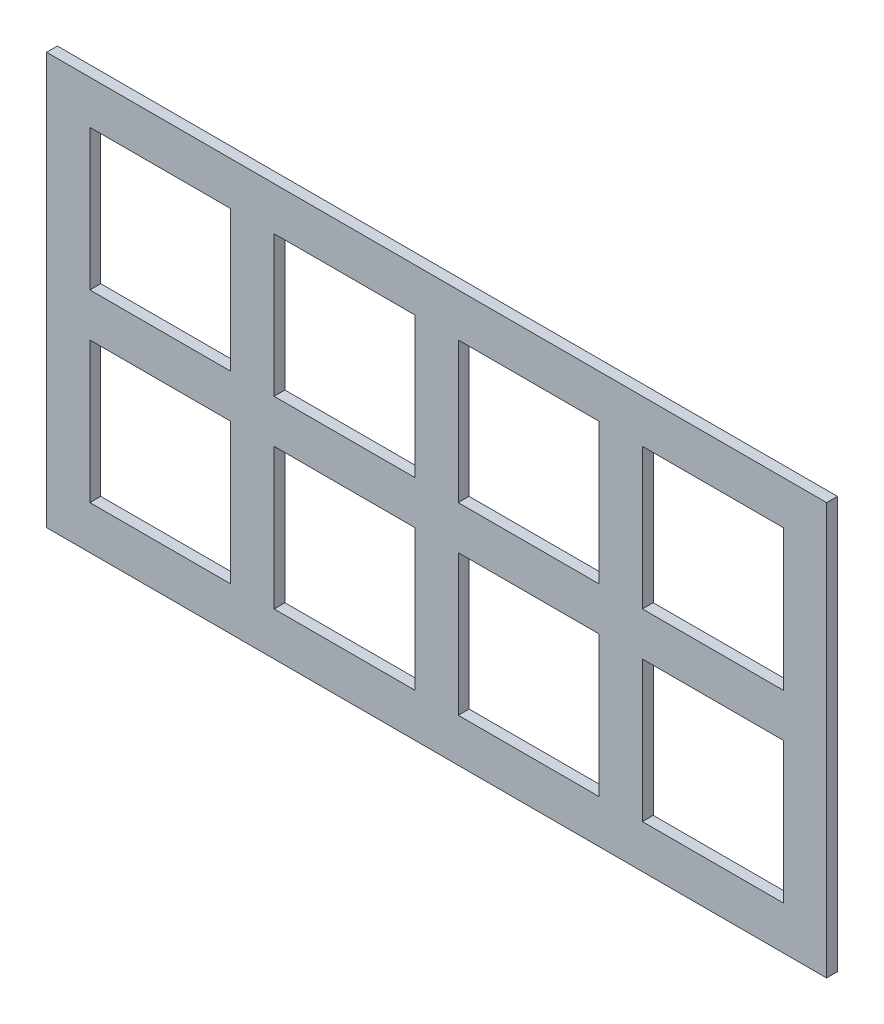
ISO-10303-21;
HEADER;
FILE_DESCRIPTION(('STEP AP214'),'2;1');
FILE_NAME('part.step','',(''),(''),'','','');
FILE_SCHEMA(('AUTOMOTIVE_DESIGN { 1 0 10303 214 1 1 1 1 }'));
ENDSEC;
DATA;
#1=APPLICATION_CONTEXT('core data for automotive mechanical design processes');
#2=APPLICATION_PROTOCOL_DEFINITION('international standard','automotive_design',2000,#1);
#3=PRODUCT_CONTEXT('',#1,'mechanical');
#4=PRODUCT('Part','Part','',(#3));
#5=PRODUCT_RELATED_PRODUCT_CATEGORY('part','',(#4));
#6=PRODUCT_DEFINITION_FORMATION('','',#4);
#7=PRODUCT_DEFINITION_CONTEXT('part definition',#1,'design');
#8=PRODUCT_DEFINITION('design','',#6,#7);
#9=PRODUCT_DEFINITION_SHAPE('','',#8);
#10=(LENGTH_UNIT() NAMED_UNIT(*) SI_UNIT(.MILLI.,.METRE.));
#11=(NAMED_UNIT(*) PLANE_ANGLE_UNIT() SI_UNIT($,.RADIAN.));
#12=(NAMED_UNIT(*) SI_UNIT($,.STERADIAN.) SOLID_ANGLE_UNIT());
#13=UNCERTAINTY_MEASURE_WITH_UNIT(LENGTH_MEASURE(1.E-05),#10,'distance_accuracy_value','');
#14=(GEOMETRIC_REPRESENTATION_CONTEXT(3) GLOBAL_UNCERTAINTY_ASSIGNED_CONTEXT((#13)) GLOBAL_UNIT_ASSIGNED_CONTEXT((#10,
#11,#12)) REPRESENTATION_CONTEXT('',''));
#15=CARTESIAN_POINT('',(0.,0.,0.));
#16=DIRECTION('',(0.,0.,1.));
#17=DIRECTION('',(1.,0.,0.));
#18=AXIS2_PLACEMENT_3D('',#15,#16,#17);
#19=CARTESIAN_POINT('',(0.,0.,12.7));
#20=DIRECTION('',(0.,0.,-1.));
#21=DIRECTION('',(-1.,0.,0.));
#22=AXIS2_PLACEMENT_3D('',#19,#20,#21);
#23=PLANE('',#22);
#24=DIRECTION('',(0.,-1.,0.));
#25=VECTOR('',#24,1.);
#26=CARTESIAN_POINT('',(-406.4,25.4,12.7));
#27=LINE('',#26,#25);
#28=CARTESIAN_POINT('',(-406.4,190.5,12.7));
#29=VERTEX_POINT('',#28);
#30=CARTESIAN_POINT('',(-406.4,25.4,12.7));
#31=VERTEX_POINT('',#30);
#32=EDGE_CURVE('E334',#29,#31,#27,.T.);
#33=ORIENTED_EDGE('',*,*,#32,.F.);
#34=DIRECTION('',(-1.,0.,0.));
#35=VECTOR('',#34,1.);
#36=CARTESIAN_POINT('',(-406.4,190.5,12.7));
#37=LINE('',#36,#35);
#38=CARTESIAN_POINT('',(-241.3,190.5,12.7));
#39=VERTEX_POINT('',#38);
#40=EDGE_CURVE('E345',#39,#29,#37,.T.);
#41=ORIENTED_EDGE('',*,*,#40,.F.);
#42=DIRECTION('',(0.,1.,0.));
#43=VECTOR('',#42,1.);
#44=CARTESIAN_POINT('',(-241.3,25.4,12.7));
#45=LINE('',#44,#43);
#46=CARTESIAN_POINT('',(-241.3,25.4,12.7));
#47=VERTEX_POINT('',#46);
#48=EDGE_CURVE('E341',#47,#39,#45,.T.);
#49=ORIENTED_EDGE('',*,*,#48,.F.);
#50=DIRECTION('',(1.,0.,0.));
#51=VECTOR('',#50,1.);
#52=CARTESIAN_POINT('',(-406.4,25.4,12.7));
#53=LINE('',#52,#51);
#54=EDGE_CURVE('E337',#31,#47,#53,.T.);
#55=ORIENTED_EDGE('',*,*,#54,.F.);
#56=EDGE_LOOP('',(#33,#41,#49,#55));
#57=FACE_BOUND('',#56,.T.);
#58=DIRECTION('',(0.,1.,0.));
#59=VECTOR('',#58,1.);
#60=CARTESIAN_POINT('',(406.4,25.4,12.7));
#61=LINE('',#60,#59);
#62=CARTESIAN_POINT('',(406.4,25.4,12.7));
#63=VERTEX_POINT('',#62);
#64=CARTESIAN_POINT('',(406.4,190.5,12.7));
#65=VERTEX_POINT('',#64);
#66=EDGE_CURVE('E420',#63,#65,#61,.T.);
#67=ORIENTED_EDGE('',*,*,#66,.F.);
#68=DIRECTION('',(1.,0.,0.));
#69=VECTOR('',#68,1.);
#70=CARTESIAN_POINT('',(241.3,25.4,12.7));
#71=LINE('',#70,#69);
#72=CARTESIAN_POINT('',(241.3,25.4,12.7));
#73=VERTEX_POINT('',#72);
#74=EDGE_CURVE('E431',#73,#63,#71,.T.);
#75=ORIENTED_EDGE('',*,*,#74,.F.);
#76=DIRECTION('',(0.,-1.,0.));
#77=VECTOR('',#76,1.);
#78=CARTESIAN_POINT('',(241.3,25.4,12.7));
#79=LINE('',#78,#77);
#80=CARTESIAN_POINT('',(241.3,190.5,12.7));
#81=VERTEX_POINT('',#80);
#82=EDGE_CURVE('E427',#81,#73,#79,.T.);
#83=ORIENTED_EDGE('',*,*,#82,.F.);
#84=DIRECTION('',(-1.,0.,0.));
#85=VECTOR('',#84,1.);
#86=CARTESIAN_POINT('',(241.3,190.5,12.7));
#87=LINE('',#86,#85);
#88=EDGE_CURVE('E423',#65,#81,#87,.T.);
#89=ORIENTED_EDGE('',*,*,#88,.F.);
#90=EDGE_LOOP('',(#67,#75,#83,#89));
#91=FACE_BOUND('',#90,.T.);
#92=DIRECTION('',(1.,0.,0.));
#93=VECTOR('',#92,1.);
#94=CARTESIAN_POINT('',(-190.5,25.4,12.7));
#95=LINE('',#94,#93);
#96=CARTESIAN_POINT('',(-190.5,25.4,12.7));
#97=VERTEX_POINT('',#96);
#98=CARTESIAN_POINT('',(-25.4,25.4,12.7));
#99=VERTEX_POINT('',#98);
#100=EDGE_CURVE('E506',#97,#99,#95,.T.);
#101=ORIENTED_EDGE('',*,*,#100,.F.);
#102=DIRECTION('',(0.,-1.,0.));
#103=VECTOR('',#102,1.);
#104=CARTESIAN_POINT('',(-190.5,25.4,12.7));
#105=LINE('',#104,#103);
#106=CARTESIAN_POINT('',(-190.5,190.5,12.7));
#107=VERTEX_POINT('',#106);
#108=EDGE_CURVE('E517',#107,#97,#105,.T.);
#109=ORIENTED_EDGE('',*,*,#108,.F.);
#110=DIRECTION('',(-1.,0.,0.));
#111=VECTOR('',#110,1.);
#112=CARTESIAN_POINT('',(-190.5,190.5,12.7));
#113=LINE('',#112,#111);
#114=CARTESIAN_POINT('',(-25.4,190.5,12.7));
#115=VERTEX_POINT('',#114);
#116=EDGE_CURVE('E513',#115,#107,#113,.T.);
#117=ORIENTED_EDGE('',*,*,#116,.F.);
#118=DIRECTION('',(0.,1.,0.));
#119=VECTOR('',#118,1.);
#120=CARTESIAN_POINT('',(-25.4,25.4,12.7));
#121=LINE('',#120,#119);
#122=EDGE_CURVE('E509',#99,#115,#121,.T.);
#123=ORIENTED_EDGE('',*,*,#122,.F.);
#124=EDGE_LOOP('',(#101,#109,#117,#123));
#125=FACE_BOUND('',#124,.T.);
#126=DIRECTION('',(1.,0.,0.));
#127=VECTOR('',#126,1.);
#128=CARTESIAN_POINT('',(25.4,25.4,12.7));
#129=LINE('',#128,#127);
#130=CARTESIAN_POINT('',(25.4,25.4,12.7));
#131=VERTEX_POINT('',#130);
#132=CARTESIAN_POINT('',(190.5,25.4,12.7));
#133=VERTEX_POINT('',#132);
#134=EDGE_CURVE('E592',#131,#133,#129,.T.);
#135=ORIENTED_EDGE('',*,*,#134,.F.);
#136=DIRECTION('',(0.,-1.,0.));
#137=VECTOR('',#136,1.);
#138=CARTESIAN_POINT('',(25.4,25.4,12.7));
#139=LINE('',#138,#137);
#140=CARTESIAN_POINT('',(25.4,190.5,12.7));
#141=VERTEX_POINT('',#140);
#142=EDGE_CURVE('E603',#141,#131,#139,.T.);
#143=ORIENTED_EDGE('',*,*,#142,.F.);
#144=DIRECTION('',(-1.,0.,0.));
#145=VECTOR('',#144,1.);
#146=CARTESIAN_POINT('',(25.4,190.5,12.7));
#147=LINE('',#146,#145);
#148=CARTESIAN_POINT('',(190.5,190.5,12.7));
#149=VERTEX_POINT('',#148);
#150=EDGE_CURVE('E599',#149,#141,#147,.T.);
#151=ORIENTED_EDGE('',*,*,#150,.F.);
#152=DIRECTION('',(0.,1.,0.));
#153=VECTOR('',#152,1.);
#154=CARTESIAN_POINT('',(190.5,25.4,12.7));
#155=LINE('',#154,#153);
#156=EDGE_CURVE('E595',#133,#149,#155,.T.);
#157=ORIENTED_EDGE('',*,*,#156,.F.);
#158=EDGE_LOOP('',(#135,#143,#151,#157));
#159=FACE_BOUND('',#158,.T.);
#160=DIRECTION('',(0.,1.,0.));
#161=VECTOR('',#160,1.);
#162=CARTESIAN_POINT('',(457.2,-241.3,12.7));
#163=LINE('',#162,#161);
#164=CARTESIAN_POINT('',(457.2,-241.3,12.7));
#165=VERTEX_POINT('',#164);
#166=CARTESIAN_POINT('',(457.2,241.3,12.7));
#167=VERTEX_POINT('',#166);
#168=EDGE_CURVE('E635',#165,#167,#163,.T.);
#169=ORIENTED_EDGE('',*,*,#168,.T.);
#170=DIRECTION('',(-1.,0.,0.));
#171=VECTOR('',#170,1.);
#172=CARTESIAN_POINT('',(-457.2,241.3,12.7));
#173=LINE('',#172,#171);
#174=CARTESIAN_POINT('',(-457.2,241.3,12.7));
#175=VERTEX_POINT('',#174);
#176=EDGE_CURVE('E639',#167,#175,#173,.T.);
#177=ORIENTED_EDGE('',*,*,#176,.T.);
#178=DIRECTION('',(0.,-1.,0.));
#179=VECTOR('',#178,1.);
#180=CARTESIAN_POINT('',(-457.2,-241.3,12.7));
#181=LINE('',#180,#179);
#182=CARTESIAN_POINT('',(-457.2,-241.3,12.7));
#183=VERTEX_POINT('',#182);
#184=EDGE_CURVE('E643',#175,#183,#181,.T.);
#185=ORIENTED_EDGE('',*,*,#184,.T.);
#186=DIRECTION('',(1.,0.,0.));
#187=VECTOR('',#186,1.);
#188=CARTESIAN_POINT('',(-457.2,-241.3,12.7));
#189=LINE('',#188,#187);
#190=EDGE_CURVE('E646',#183,#165,#189,.T.);
#191=ORIENTED_EDGE('',*,*,#190,.T.);
#192=EDGE_LOOP('',(#169,#177,#185,#191));
#193=FACE_BOUND('',#192,.T.);
#194=DIRECTION('',(-1.,0.,0.));
#195=VECTOR('',#194,1.);
#196=CARTESIAN_POINT('',(-190.5,-25.4,12.7));
#197=LINE('',#196,#195);
#198=CARTESIAN_POINT('',(-25.4,-25.4,12.7));
#199=VERTEX_POINT('',#198);
#200=CARTESIAN_POINT('',(-190.5,-25.4,12.7));
#201=VERTEX_POINT('',#200);
#202=EDGE_CURVE('E549',#199,#201,#197,.T.);
#203=ORIENTED_EDGE('',*,*,#202,.F.);
#204=DIRECTION('',(0.,1.,0.));
#205=VECTOR('',#204,1.);
#206=CARTESIAN_POINT('',(-25.4,-190.5,12.7));
#207=LINE('',#206,#205);
#208=CARTESIAN_POINT('',(-25.4,-190.5,12.7));
#209=VERTEX_POINT('',#208);
#210=EDGE_CURVE('E560',#209,#199,#207,.T.);
#211=ORIENTED_EDGE('',*,*,#210,.F.);
#212=DIRECTION('',(1.,0.,0.));
#213=VECTOR('',#212,1.);
#214=CARTESIAN_POINT('',(-190.5,-190.5,12.7));
#215=LINE('',#214,#213);
#216=CARTESIAN_POINT('',(-190.5,-190.5,12.7));
#217=VERTEX_POINT('',#216);
#218=EDGE_CURVE('E556',#217,#209,#215,.T.);
#219=ORIENTED_EDGE('',*,*,#218,.F.);
#220=DIRECTION('',(0.,-1.,0.));
#221=VECTOR('',#220,1.);
#222=CARTESIAN_POINT('',(-190.5,-190.5,12.7));
#223=LINE('',#222,#221);
#224=EDGE_CURVE('E552',#201,#217,#223,.T.);
#225=ORIENTED_EDGE('',*,*,#224,.F.);
#226=EDGE_LOOP('',(#203,#211,#219,#225));
#227=FACE_BOUND('',#226,.T.);
#228=DIRECTION('',(-1.,0.,0.));
#229=VECTOR('',#228,1.);
#230=CARTESIAN_POINT('',(25.4,-25.4,12.7));
#231=LINE('',#230,#229);
#232=CARTESIAN_POINT('',(190.5,-25.4,12.7));
#233=VERTEX_POINT('',#232);
#234=CARTESIAN_POINT('',(25.4,-25.4,12.7));
#235=VERTEX_POINT('',#234);
#236=EDGE_CURVE('E463',#233,#235,#231,.T.);
#237=ORIENTED_EDGE('',*,*,#236,.F.);
#238=DIRECTION('',(0.,1.,0.));
#239=VECTOR('',#238,1.);
#240=CARTESIAN_POINT('',(190.5,-190.5,12.7));
#241=LINE('',#240,#239);
#242=CARTESIAN_POINT('',(190.5,-190.5,12.7));
#243=VERTEX_POINT('',#242);
#244=EDGE_CURVE('E474',#243,#233,#241,.T.);
#245=ORIENTED_EDGE('',*,*,#244,.F.);
#246=DIRECTION('',(1.,0.,0.));
#247=VECTOR('',#246,1.);
#248=CARTESIAN_POINT('',(25.4,-190.5,12.7));
#249=LINE('',#248,#247);
#250=CARTESIAN_POINT('',(25.4,-190.5,12.7));
#251=VERTEX_POINT('',#250);
#252=EDGE_CURVE('E470',#251,#243,#249,.T.);
#253=ORIENTED_EDGE('',*,*,#252,.F.);
#254=DIRECTION('',(0.,-1.,0.));
#255=VECTOR('',#254,1.);
#256=CARTESIAN_POINT('',(25.4,-190.5,12.7));
#257=LINE('',#256,#255);
#258=EDGE_CURVE('E466',#235,#251,#257,.T.);
#259=ORIENTED_EDGE('',*,*,#258,.F.);
#260=EDGE_LOOP('',(#237,#245,#253,#259));
#261=FACE_BOUND('',#260,.T.);
#262=DIRECTION('',(0.,-1.,0.));
#263=VECTOR('',#262,1.);
#264=CARTESIAN_POINT('',(-406.4,-190.5,12.7));
#265=LINE('',#264,#263);
#266=CARTESIAN_POINT('',(-406.4,-25.4,12.7));
#267=VERTEX_POINT('',#266);
#268=CARTESIAN_POINT('',(-406.4,-190.5,12.7));
#269=VERTEX_POINT('',#268);
#270=EDGE_CURVE('E377',#267,#269,#265,.T.);
#271=ORIENTED_EDGE('',*,*,#270,.F.);
#272=DIRECTION('',(-1.,0.,0.));
#273=VECTOR('',#272,1.);
#274=CARTESIAN_POINT('',(-406.4,-25.4,12.7));
#275=LINE('',#274,#273);
#276=CARTESIAN_POINT('',(-241.3,-25.4,12.7));
#277=VERTEX_POINT('',#276);
#278=EDGE_CURVE('E388',#277,#267,#275,.T.);
#279=ORIENTED_EDGE('',*,*,#278,.F.);
#280=DIRECTION('',(0.,1.,0.));
#281=VECTOR('',#280,1.);
#282=CARTESIAN_POINT('',(-241.3,-190.5,12.7));
#283=LINE('',#282,#281);
#284=CARTESIAN_POINT('',(-241.3,-190.5,12.7));
#285=VERTEX_POINT('',#284);
#286=EDGE_CURVE('E384',#285,#277,#283,.T.);
#287=ORIENTED_EDGE('',*,*,#286,.F.);
#288=DIRECTION('',(1.,0.,0.));
#289=VECTOR('',#288,1.);
#290=CARTESIAN_POINT('',(-406.4,-190.5,12.7));
#291=LINE('',#290,#289);
#292=EDGE_CURVE('E380',#269,#285,#291,.T.);
#293=ORIENTED_EDGE('',*,*,#292,.F.);
#294=EDGE_LOOP('',(#271,#279,#287,#293));
#295=FACE_BOUND('',#294,.T.);
#296=DIRECTION('',(1.,0.,0.));
#297=VECTOR('',#296,1.);
#298=CARTESIAN_POINT('',(241.3,-190.5,12.7));
#299=LINE('',#298,#297);
#300=CARTESIAN_POINT('',(241.3,-190.5,12.7));
#301=VERTEX_POINT('',#300);
#302=CARTESIAN_POINT('',(406.4,-190.5,12.7));
#303=VERTEX_POINT('',#302);
#304=EDGE_CURVE('E285',#301,#303,#299,.T.);
#305=ORIENTED_EDGE('',*,*,#304,.F.);
#306=DIRECTION('',(0.,-1.,0.));
#307=VECTOR('',#306,1.);
#308=CARTESIAN_POINT('',(241.3,-190.5,12.7));
#309=LINE('',#308,#307);
#310=CARTESIAN_POINT('',(241.3,-25.4,12.7));
#311=VERTEX_POINT('',#310);
#312=EDGE_CURVE('E312',#311,#301,#309,.T.);
#313=ORIENTED_EDGE('',*,*,#312,.F.);
#314=DIRECTION('',(-1.,0.,0.));
#315=VECTOR('',#314,1.);
#316=CARTESIAN_POINT('',(241.3,-25.4,12.7));
#317=LINE('',#316,#315);
#318=CARTESIAN_POINT('',(406.4,-25.4,12.7));
#319=VERTEX_POINT('',#318);
#320=EDGE_CURVE('E307',#319,#311,#317,.T.);
#321=ORIENTED_EDGE('',*,*,#320,.F.);
#322=DIRECTION('',(0.,1.,0.));
#323=VECTOR('',#322,1.);
#324=CARTESIAN_POINT('',(406.4,-190.5,12.7));
#325=LINE('',#324,#323);
#326=EDGE_CURVE('E294',#303,#319,#325,.T.);
#327=ORIENTED_EDGE('',*,*,#326,.F.);
#328=EDGE_LOOP('',(#305,#313,#321,#327));
#329=FACE_BOUND('',#328,.T.);
#330=ADVANCED_FACE('F51',(#57,#91,#125,#159,#193,#227,#261,#295,#329),#23,.F.);
#331=CARTESIAN_POINT('',(0.,0.,0.));
#332=DIRECTION('',(0.,0.,-1.));
#333=DIRECTION('',(-1.,0.,0.));
#334=AXIS2_PLACEMENT_3D('',#331,#332,#333);
#335=PLANE('',#334);
#336=DIRECTION('',(0.,1.,0.));
#337=VECTOR('',#336,1.);
#338=CARTESIAN_POINT('',(457.2,-241.3,0.));
#339=LINE('',#338,#337);
#340=CARTESIAN_POINT('',(457.2,-241.3,0.));
#341=VERTEX_POINT('',#340);
#342=CARTESIAN_POINT('',(457.2,241.3,0.));
#343=VERTEX_POINT('',#342);
#344=EDGE_CURVE('E634',#341,#343,#339,.T.);
#345=ORIENTED_EDGE('',*,*,#344,.F.);
#346=DIRECTION('',(1.,0.,0.));
#347=VECTOR('',#346,1.);
#348=CARTESIAN_POINT('',(-457.2,-241.3,0.));
#349=LINE('',#348,#347);
#350=CARTESIAN_POINT('',(-457.2,-241.3,0.));
#351=VERTEX_POINT('',#350);
#352=EDGE_CURVE('E640',#351,#341,#349,.T.);
#353=ORIENTED_EDGE('',*,*,#352,.F.);
#354=DIRECTION('',(0.,-1.,0.));
#355=VECTOR('',#354,1.);
#356=CARTESIAN_POINT('',(-457.2,-241.3,0.));
#357=LINE('',#356,#355);
#358=CARTESIAN_POINT('',(-457.2,241.3,0.));
#359=VERTEX_POINT('',#358);
#360=EDGE_CURVE('E656',#359,#351,#357,.T.);
#361=ORIENTED_EDGE('',*,*,#360,.F.);
#362=DIRECTION('',(-1.,0.,0.));
#363=VECTOR('',#362,1.);
#364=CARTESIAN_POINT('',(-457.2,241.3,0.));
#365=LINE('',#364,#363);
#366=EDGE_CURVE('E653',#343,#359,#365,.T.);
#367=ORIENTED_EDGE('',*,*,#366,.F.);
#368=EDGE_LOOP('',(#345,#353,#361,#367));
#369=FACE_BOUND('',#368,.T.);
#370=DIRECTION('',(0.,-1.,0.));
#371=VECTOR('',#370,1.);
#372=CARTESIAN_POINT('',(25.4,25.4,0.));
#373=LINE('',#372,#371);
#374=CARTESIAN_POINT('',(25.4,190.5,0.));
#375=VERTEX_POINT('',#374);
#376=CARTESIAN_POINT('',(25.4,25.4,0.));
#377=VERTEX_POINT('',#376);
#378=EDGE_CURVE('E596',#375,#377,#373,.T.);
#379=ORIENTED_EDGE('',*,*,#378,.T.);
#380=DIRECTION('',(1.,0.,0.));
#381=VECTOR('',#380,1.);
#382=CARTESIAN_POINT('',(25.4,25.4,0.));
#383=LINE('',#382,#381);
#384=CARTESIAN_POINT('',(190.5,25.4,0.));
#385=VERTEX_POINT('',#384);
#386=EDGE_CURVE('E591',#377,#385,#383,.T.);
#387=ORIENTED_EDGE('',*,*,#386,.T.);
#388=DIRECTION('',(0.,1.,0.));
#389=VECTOR('',#388,1.);
#390=CARTESIAN_POINT('',(190.5,25.4,0.));
#391=LINE('',#390,#389);
#392=CARTESIAN_POINT('',(190.5,190.5,0.));
#393=VERTEX_POINT('',#392);
#394=EDGE_CURVE('E610',#385,#393,#391,.T.);
#395=ORIENTED_EDGE('',*,*,#394,.T.);
#396=DIRECTION('',(-1.,0.,0.));
#397=VECTOR('',#396,1.);
#398=CARTESIAN_POINT('',(25.4,190.5,0.));
#399=LINE('',#398,#397);
#400=EDGE_CURVE('E614',#393,#375,#399,.T.);
#401=ORIENTED_EDGE('',*,*,#400,.T.);
#402=EDGE_LOOP('',(#379,#387,#395,#401));
#403=FACE_BOUND('',#402,.T.);
#404=DIRECTION('',(0.,1.,0.));
#405=VECTOR('',#404,1.);
#406=CARTESIAN_POINT('',(-25.4,-190.5,0.));
#407=LINE('',#406,#405);
#408=CARTESIAN_POINT('',(-25.4,-190.5,0.));
#409=VERTEX_POINT('',#408);
#410=CARTESIAN_POINT('',(-25.4,-25.4,0.));
#411=VERTEX_POINT('',#410);
#412=EDGE_CURVE('E553',#409,#411,#407,.T.);
#413=ORIENTED_EDGE('',*,*,#412,.T.);
#414=DIRECTION('',(-1.,0.,0.));
#415=VECTOR('',#414,1.);
#416=CARTESIAN_POINT('',(-190.5,-25.4,0.));
#417=LINE('',#416,#415);
#418=CARTESIAN_POINT('',(-190.5,-25.4,0.));
#419=VERTEX_POINT('',#418);
#420=EDGE_CURVE('E548',#411,#419,#417,.T.);
#421=ORIENTED_EDGE('',*,*,#420,.T.);
#422=DIRECTION('',(0.,-1.,0.));
#423=VECTOR('',#422,1.);
#424=CARTESIAN_POINT('',(-190.5,-190.5,0.));
#425=LINE('',#424,#423);
#426=CARTESIAN_POINT('',(-190.5,-190.5,0.));
#427=VERTEX_POINT('',#426);
#428=EDGE_CURVE('E567',#419,#427,#425,.T.);
#429=ORIENTED_EDGE('',*,*,#428,.T.);
#430=DIRECTION('',(1.,0.,0.));
#431=VECTOR('',#430,1.);
#432=CARTESIAN_POINT('',(-190.5,-190.5,0.));
#433=LINE('',#432,#431);
#434=EDGE_CURVE('E571',#427,#409,#433,.T.);
#435=ORIENTED_EDGE('',*,*,#434,.T.);
#436=EDGE_LOOP('',(#413,#421,#429,#435));
#437=FACE_BOUND('',#436,.T.);
#438=DIRECTION('',(0.,-1.,0.));
#439=VECTOR('',#438,1.);
#440=CARTESIAN_POINT('',(-190.5,25.4,0.));
#441=LINE('',#440,#439);
#442=CARTESIAN_POINT('',(-190.5,190.5,0.));
#443=VERTEX_POINT('',#442);
#444=CARTESIAN_POINT('',(-190.5,25.4,0.));
#445=VERTEX_POINT('',#444);
#446=EDGE_CURVE('E510',#443,#445,#441,.T.);
#447=ORIENTED_EDGE('',*,*,#446,.T.);
#448=DIRECTION('',(1.,0.,0.));
#449=VECTOR('',#448,1.);
#450=CARTESIAN_POINT('',(-190.5,25.4,0.));
#451=LINE('',#450,#449);
#452=CARTESIAN_POINT('',(-25.4,25.4,0.));
#453=VERTEX_POINT('',#452);
#454=EDGE_CURVE('E505',#445,#453,#451,.T.);
#455=ORIENTED_EDGE('',*,*,#454,.T.);
#456=DIRECTION('',(0.,1.,0.));
#457=VECTOR('',#456,1.);
#458=CARTESIAN_POINT('',(-25.4,25.4,0.));
#459=LINE('',#458,#457);
#460=CARTESIAN_POINT('',(-25.4,190.5,0.));
#461=VERTEX_POINT('',#460);
#462=EDGE_CURVE('E524',#453,#461,#459,.T.);
#463=ORIENTED_EDGE('',*,*,#462,.T.);
#464=DIRECTION('',(-1.,0.,0.));
#465=VECTOR('',#464,1.);
#466=CARTESIAN_POINT('',(-190.5,190.5,0.));
#467=LINE('',#466,#465);
#468=EDGE_CURVE('E528',#461,#443,#467,.T.);
#469=ORIENTED_EDGE('',*,*,#468,.T.);
#470=EDGE_LOOP('',(#447,#455,#463,#469));
#471=FACE_BOUND('',#470,.T.);
#472=DIRECTION('',(0.,1.,0.));
#473=VECTOR('',#472,1.);
#474=CARTESIAN_POINT('',(190.5,-190.5,0.));
#475=LINE('',#474,#473);
#476=CARTESIAN_POINT('',(190.5,-190.5,0.));
#477=VERTEX_POINT('',#476);
#478=CARTESIAN_POINT('',(190.5,-25.4,0.));
#479=VERTEX_POINT('',#478);
#480=EDGE_CURVE('E467',#477,#479,#475,.T.);
#481=ORIENTED_EDGE('',*,*,#480,.T.);
#482=DIRECTION('',(-1.,0.,0.));
#483=VECTOR('',#482,1.);
#484=CARTESIAN_POINT('',(25.4,-25.4,0.));
#485=LINE('',#484,#483);
#486=CARTESIAN_POINT('',(25.4,-25.4,0.));
#487=VERTEX_POINT('',#486);
#488=EDGE_CURVE('E462',#479,#487,#485,.T.);
#489=ORIENTED_EDGE('',*,*,#488,.T.);
#490=DIRECTION('',(0.,-1.,0.));
#491=VECTOR('',#490,1.);
#492=CARTESIAN_POINT('',(25.4,-190.5,0.));
#493=LINE('',#492,#491);
#494=CARTESIAN_POINT('',(25.4,-190.5,0.));
#495=VERTEX_POINT('',#494);
#496=EDGE_CURVE('E481',#487,#495,#493,.T.);
#497=ORIENTED_EDGE('',*,*,#496,.T.);
#498=DIRECTION('',(1.,0.,0.));
#499=VECTOR('',#498,1.);
#500=CARTESIAN_POINT('',(25.4,-190.5,0.));
#501=LINE('',#500,#499);
#502=EDGE_CURVE('E485',#495,#477,#501,.T.);
#503=ORIENTED_EDGE('',*,*,#502,.T.);
#504=EDGE_LOOP('',(#481,#489,#497,#503));
#505=FACE_BOUND('',#504,.T.);
#506=DIRECTION('',(1.,0.,0.));
#507=VECTOR('',#506,1.);
#508=CARTESIAN_POINT('',(241.3,25.4,0.));
#509=LINE('',#508,#507);
#510=CARTESIAN_POINT('',(241.3,25.4,0.));
#511=VERTEX_POINT('',#510);
#512=CARTESIAN_POINT('',(406.4,25.4,0.));
#513=VERTEX_POINT('',#512);
#514=EDGE_CURVE('E424',#511,#513,#509,.T.);
#515=ORIENTED_EDGE('',*,*,#514,.T.);
#516=DIRECTION('',(0.,1.,0.));
#517=VECTOR('',#516,1.);
#518=CARTESIAN_POINT('',(406.4,25.4,0.));
#519=LINE('',#518,#517);
#520=CARTESIAN_POINT('',(406.4,190.5,0.));
#521=VERTEX_POINT('',#520);
#522=EDGE_CURVE('E419',#513,#521,#519,.T.);
#523=ORIENTED_EDGE('',*,*,#522,.T.);
#524=DIRECTION('',(-1.,0.,0.));
#525=VECTOR('',#524,1.);
#526=CARTESIAN_POINT('',(241.3,190.5,0.));
#527=LINE('',#526,#525);
#528=CARTESIAN_POINT('',(241.3,190.5,0.));
#529=VERTEX_POINT('',#528);
#530=EDGE_CURVE('E438',#521,#529,#527,.T.);
#531=ORIENTED_EDGE('',*,*,#530,.T.);
#532=DIRECTION('',(0.,-1.,0.));
#533=VECTOR('',#532,1.);
#534=CARTESIAN_POINT('',(241.3,25.4,0.));
#535=LINE('',#534,#533);
#536=EDGE_CURVE('E442',#529,#511,#535,.T.);
#537=ORIENTED_EDGE('',*,*,#536,.T.);
#538=EDGE_LOOP('',(#515,#523,#531,#537));
#539=FACE_BOUND('',#538,.T.);
#540=DIRECTION('',(-1.,0.,0.));
#541=VECTOR('',#540,1.);
#542=CARTESIAN_POINT('',(-406.4,-25.4,0.));
#543=LINE('',#542,#541);
#544=CARTESIAN_POINT('',(-241.3,-25.4,0.));
#545=VERTEX_POINT('',#544);
#546=CARTESIAN_POINT('',(-406.4,-25.4,0.));
#547=VERTEX_POINT('',#546);
#548=EDGE_CURVE('E381',#545,#547,#543,.T.);
#549=ORIENTED_EDGE('',*,*,#548,.T.);
#550=DIRECTION('',(0.,-1.,0.));
#551=VECTOR('',#550,1.);
#552=CARTESIAN_POINT('',(-406.4,-190.5,0.));
#553=LINE('',#552,#551);
#554=CARTESIAN_POINT('',(-406.4,-190.5,0.));
#555=VERTEX_POINT('',#554);
#556=EDGE_CURVE('E376',#547,#555,#553,.T.);
#557=ORIENTED_EDGE('',*,*,#556,.T.);
#558=DIRECTION('',(1.,0.,0.));
#559=VECTOR('',#558,1.);
#560=CARTESIAN_POINT('',(-406.4,-190.5,0.));
#561=LINE('',#560,#559);
#562=CARTESIAN_POINT('',(-241.3,-190.5,0.));
#563=VERTEX_POINT('',#562);
#564=EDGE_CURVE('E395',#555,#563,#561,.T.);
#565=ORIENTED_EDGE('',*,*,#564,.T.);
#566=DIRECTION('',(0.,1.,0.));
#567=VECTOR('',#566,1.);
#568=CARTESIAN_POINT('',(-241.3,-190.5,0.));
#569=LINE('',#568,#567);
#570=EDGE_CURVE('E399',#563,#545,#569,.T.);
#571=ORIENTED_EDGE('',*,*,#570,.T.);
#572=EDGE_LOOP('',(#549,#557,#565,#571));
#573=FACE_BOUND('',#572,.T.);
#574=DIRECTION('',(-1.,0.,0.));
#575=VECTOR('',#574,1.);
#576=CARTESIAN_POINT('',(-406.4,190.5,0.));
#577=LINE('',#576,#575);
#578=CARTESIAN_POINT('',(-241.3,190.5,0.));
#579=VERTEX_POINT('',#578);
#580=CARTESIAN_POINT('',(-406.4,190.5,0.));
#581=VERTEX_POINT('',#580);
#582=EDGE_CURVE('E338',#579,#581,#577,.T.);
#583=ORIENTED_EDGE('',*,*,#582,.T.);
#584=DIRECTION('',(0.,-1.,0.));
#585=VECTOR('',#584,1.);
#586=CARTESIAN_POINT('',(-406.4,25.4,0.));
#587=LINE('',#586,#585);
#588=CARTESIAN_POINT('',(-406.4,25.4,0.));
#589=VERTEX_POINT('',#588);
#590=EDGE_CURVE('E303',#581,#589,#587,.T.);
#591=ORIENTED_EDGE('',*,*,#590,.T.);
#592=DIRECTION('',(1.,0.,0.));
#593=VECTOR('',#592,1.);
#594=CARTESIAN_POINT('',(-406.4,25.4,0.));
#595=LINE('',#594,#593);
#596=CARTESIAN_POINT('',(-241.3,25.4,0.));
#597=VERTEX_POINT('',#596);
#598=EDGE_CURVE('E352',#589,#597,#595,.T.);
#599=ORIENTED_EDGE('',*,*,#598,.T.);
#600=DIRECTION('',(0.,1.,0.));
#601=VECTOR('',#600,1.);
#602=CARTESIAN_POINT('',(-241.3,25.4,0.));
#603=LINE('',#602,#601);
#604=EDGE_CURVE('E356',#597,#579,#603,.T.);
#605=ORIENTED_EDGE('',*,*,#604,.T.);
#606=EDGE_LOOP('',(#583,#591,#599,#605));
#607=FACE_BOUND('',#606,.T.);
#608=DIRECTION('',(0.,-1.,0.));
#609=VECTOR('',#608,1.);
#610=CARTESIAN_POINT('',(241.3,-190.5,0.));
#611=LINE('',#610,#609);
#612=CARTESIAN_POINT('',(241.3,-25.4,0.));
#613=VERTEX_POINT('',#612);
#614=CARTESIAN_POINT('',(241.3,-190.5,0.));
#615=VERTEX_POINT('',#614);
#616=EDGE_CURVE('E295',#613,#615,#611,.T.);
#617=ORIENTED_EDGE('',*,*,#616,.T.);
#618=DIRECTION('',(1.,0.,0.));
#619=VECTOR('',#618,1.);
#620=CARTESIAN_POINT('',(241.3,-190.5,0.));
#621=LINE('',#620,#619);
#622=CARTESIAN_POINT('',(406.4,-190.5,0.));
#623=VERTEX_POINT('',#622);
#624=EDGE_CURVE('E75',#615,#623,#621,.T.);
#625=ORIENTED_EDGE('',*,*,#624,.T.);
#626=DIRECTION('',(0.,1.,0.));
#627=VECTOR('',#626,1.);
#628=CARTESIAN_POINT('',(406.4,-190.5,0.));
#629=LINE('',#628,#627);
#630=CARTESIAN_POINT('',(406.4,-25.4,0.));
#631=VERTEX_POINT('',#630);
#632=EDGE_CURVE('E301',#623,#631,#629,.T.);
#633=ORIENTED_EDGE('',*,*,#632,.T.);
#634=DIRECTION('',(-1.,0.,0.));
#635=VECTOR('',#634,1.);
#636=CARTESIAN_POINT('',(241.3,-25.4,0.));
#637=LINE('',#636,#635);
#638=EDGE_CURVE('E321',#631,#613,#637,.T.);
#639=ORIENTED_EDGE('',*,*,#638,.T.);
#640=EDGE_LOOP('',(#617,#625,#633,#639));
#641=FACE_BOUND('',#640,.T.);
#642=ADVANCED_FACE('F680',(#369,#403,#437,#471,#505,#539,#573,#607,#641),#335,.T.);
#643=CARTESIAN_POINT('',(457.2,-241.3,12.7));
#644=DIRECTION('',(-1.,0.,0.));
#645=DIRECTION('',(0.,0.,1.));
#646=AXIS2_PLACEMENT_3D('',#643,#644,#645);
#647=PLANE('',#646);
#648=ORIENTED_EDGE('',*,*,#344,.T.);
#649=DIRECTION('',(0.,0.,-1.));
#650=VECTOR('',#649,1.);
#651=CARTESIAN_POINT('',(457.2,241.3,12.7));
#652=LINE('',#651,#650);
#653=EDGE_CURVE('E11',#167,#343,#652,.T.);
#654=ORIENTED_EDGE('',*,*,#653,.F.);
#655=ORIENTED_EDGE('',*,*,#168,.F.);
#656=DIRECTION('',(0.,0.,-1.));
#657=VECTOR('',#656,1.);
#658=CARTESIAN_POINT('',(457.2,-241.3,12.7));
#659=LINE('',#658,#657);
#660=EDGE_CURVE('E649',#165,#341,#659,.T.);
#661=ORIENTED_EDGE('',*,*,#660,.T.);
#662=EDGE_LOOP('',(#648,#654,#655,#661));
#663=FACE_BOUND('',#662,.T.);
#664=ADVANCED_FACE('F53',(#663),#647,.F.);
#665=CARTESIAN_POINT('',(-457.2,241.3,12.7));
#666=DIRECTION('',(0.,-1.,0.));
#667=DIRECTION('',(0.,0.,-1.));
#668=AXIS2_PLACEMENT_3D('',#665,#666,#667);
#669=PLANE('',#668);
#670=ORIENTED_EDGE('',*,*,#366,.T.);
#671=DIRECTION('',(0.,0.,-1.));
#672=VECTOR('',#671,1.);
#673=CARTESIAN_POINT('',(-457.2,241.3,12.7));
#674=LINE('',#673,#672);
#675=EDGE_CURVE('E60',#175,#359,#674,.T.);
#676=ORIENTED_EDGE('',*,*,#675,.F.);
#677=ORIENTED_EDGE('',*,*,#176,.F.);
#678=ORIENTED_EDGE('',*,*,#653,.T.);
#679=EDGE_LOOP('',(#670,#676,#677,#678));
#680=FACE_BOUND('',#679,.T.);
#681=ADVANCED_FACE('F691',(#680),#669,.F.);
#682=CARTESIAN_POINT('',(-457.2,-241.3,12.7));
#683=DIRECTION('',(1.,0.,0.));
#684=DIRECTION('',(0.,0.,-1.));
#685=AXIS2_PLACEMENT_3D('',#682,#683,#684);
#686=PLANE('',#685);
#687=ORIENTED_EDGE('',*,*,#360,.T.);
#688=DIRECTION('',(0.,0.,-1.));
#689=VECTOR('',#688,1.);
#690=CARTESIAN_POINT('',(-457.2,-241.3,12.7));
#691=LINE('',#690,#689);
#692=EDGE_CURVE('E664',#183,#351,#691,.T.);
#693=ORIENTED_EDGE('',*,*,#692,.F.);
#694=ORIENTED_EDGE('',*,*,#184,.F.);
#695=ORIENTED_EDGE('',*,*,#675,.T.);
#696=EDGE_LOOP('',(#687,#693,#694,#695));
#697=FACE_BOUND('',#696,.T.);
#698=ADVANCED_FACE('F674',(#697),#686,.F.);
#699=CARTESIAN_POINT('',(-457.2,-241.3,12.7));
#700=DIRECTION('',(0.,1.,0.));
#701=DIRECTION('',(0.,0.,1.));
#702=AXIS2_PLACEMENT_3D('',#699,#700,#701);
#703=PLANE('',#702);
#704=ORIENTED_EDGE('',*,*,#352,.T.);
#705=ORIENTED_EDGE('',*,*,#660,.F.);
#706=ORIENTED_EDGE('',*,*,#190,.F.);
#707=ORIENTED_EDGE('',*,*,#692,.T.);
#708=EDGE_LOOP('',(#704,#705,#706,#707));
#709=FACE_BOUND('',#708,.T.);
#710=ADVANCED_FACE('F684',(#709),#703,.F.);
#711=CARTESIAN_POINT('',(25.4,25.4,12.7));
#712=DIRECTION('',(0.,1.,0.));
#713=DIRECTION('',(-1.,0.,0.));
#714=AXIS2_PLACEMENT_3D('',#711,#712,#713);
#715=PLANE('',#714);
#716=ORIENTED_EDGE('',*,*,#386,.F.);
#717=DIRECTION('',(0.,0.,-1.));
#718=VECTOR('',#717,1.);
#719=CARTESIAN_POINT('',(25.4,25.4,12.7));
#720=LINE('',#719,#718);
#721=EDGE_CURVE('E606',#131,#377,#720,.T.);
#722=ORIENTED_EDGE('',*,*,#721,.F.);
#723=ORIENTED_EDGE('',*,*,#134,.T.);
#724=DIRECTION('',(0.,0.,-1.));
#725=VECTOR('',#724,1.);
#726=CARTESIAN_POINT('',(190.5,25.4,12.7));
#727=LINE('',#726,#725);
#728=EDGE_CURVE('E630',#133,#385,#727,.T.);
#729=ORIENTED_EDGE('',*,*,#728,.T.);
#730=EDGE_LOOP('',(#716,#722,#723,#729));
#731=FACE_BOUND('',#730,.T.);
#732=ADVANCED_FACE('F706',(#731),#715,.T.);
#733=CARTESIAN_POINT('',(190.5,25.4,12.7));
#734=DIRECTION('',(-1.,0.,0.));
#735=DIRECTION('',(0.,0.,1.));
#736=AXIS2_PLACEMENT_3D('',#733,#734,#735);
#737=PLANE('',#736);
#738=ORIENTED_EDGE('',*,*,#394,.F.);
#739=ORIENTED_EDGE('',*,*,#728,.F.);
#740=ORIENTED_EDGE('',*,*,#156,.T.);
#741=DIRECTION('',(0.,0.,-1.));
#742=VECTOR('',#741,1.);
#743=CARTESIAN_POINT('',(190.5,190.5,12.7));
#744=LINE('',#743,#742);
#745=EDGE_CURVE('E627',#149,#393,#744,.T.);
#746=ORIENTED_EDGE('',*,*,#745,.T.);
#747=EDGE_LOOP('',(#738,#739,#740,#746));
#748=FACE_BOUND('',#747,.T.);
#749=ADVANCED_FACE('F712',(#748),#737,.T.);
#750=CARTESIAN_POINT('',(25.4,190.5,12.7));
#751=DIRECTION('',(0.,-1.,0.));
#752=DIRECTION('',(0.,0.,-1.));
#753=AXIS2_PLACEMENT_3D('',#750,#751,#752);
#754=PLANE('',#753);
#755=ORIENTED_EDGE('',*,*,#400,.F.);
#756=ORIENTED_EDGE('',*,*,#745,.F.);
#757=ORIENTED_EDGE('',*,*,#150,.T.);
#758=DIRECTION('',(0.,0.,-1.));
#759=VECTOR('',#758,1.);
#760=CARTESIAN_POINT('',(25.4,190.5,12.7));
#761=LINE('',#760,#759);
#762=EDGE_CURVE('E624',#141,#375,#761,.T.);
#763=ORIENTED_EDGE('',*,*,#762,.T.);
#764=EDGE_LOOP('',(#755,#756,#757,#763));
#765=FACE_BOUND('',#764,.T.);
#766=ADVANCED_FACE('F716',(#765),#754,.T.);
#767=CARTESIAN_POINT('',(25.4,25.4,12.7));
#768=DIRECTION('',(1.,0.,0.));
#769=DIRECTION('',(0.,1.,0.));
#770=AXIS2_PLACEMENT_3D('',#767,#768,#769);
#771=PLANE('',#770);
#772=ORIENTED_EDGE('',*,*,#378,.F.);
#773=ORIENTED_EDGE('',*,*,#762,.F.);
#774=ORIENTED_EDGE('',*,*,#142,.T.);
#775=ORIENTED_EDGE('',*,*,#721,.T.);
#776=EDGE_LOOP('',(#772,#773,#774,#775));
#777=FACE_BOUND('',#776,.T.);
#778=ADVANCED_FACE('F723',(#777),#771,.T.);
#779=CARTESIAN_POINT('',(-190.5,-25.4,12.7));
#780=DIRECTION('',(0.,-1.,0.));
#781=DIRECTION('',(1.,0.,0.));
#782=AXIS2_PLACEMENT_3D('',#779,#780,#781);
#783=PLANE('',#782);
#784=ORIENTED_EDGE('',*,*,#420,.F.);
#785=DIRECTION('',(0.,0.,-1.));
#786=VECTOR('',#785,1.);
#787=CARTESIAN_POINT('',(-25.4,-25.4,12.7));
#788=LINE('',#787,#786);
#789=EDGE_CURVE('E563',#199,#411,#788,.T.);
#790=ORIENTED_EDGE('',*,*,#789,.F.);
#791=ORIENTED_EDGE('',*,*,#202,.T.);
#792=DIRECTION('',(0.,0.,-1.));
#793=VECTOR('',#792,1.);
#794=CARTESIAN_POINT('',(-190.5,-25.4,12.7));
#795=LINE('',#794,#793);
#796=EDGE_CURVE('E587',#201,#419,#795,.T.);
#797=ORIENTED_EDGE('',*,*,#796,.T.);
#798=EDGE_LOOP('',(#784,#790,#791,#797));
#799=FACE_BOUND('',#798,.T.);
#800=ADVANCED_FACE('F736',(#799),#783,.T.);
#801=CARTESIAN_POINT('',(-190.5,-190.5,12.7));
#802=DIRECTION('',(1.,0.,0.));
#803=DIRECTION('',(0.,0.,-1.));
#804=AXIS2_PLACEMENT_3D('',#801,#802,#803);
#805=PLANE('',#804);
#806=ORIENTED_EDGE('',*,*,#428,.F.);
#807=ORIENTED_EDGE('',*,*,#796,.F.);
#808=ORIENTED_EDGE('',*,*,#224,.T.);
#809=DIRECTION('',(0.,0.,-1.));
#810=VECTOR('',#809,1.);
#811=CARTESIAN_POINT('',(-190.5,-190.5,12.7));
#812=LINE('',#811,#810);
#813=EDGE_CURVE('E584',#217,#427,#812,.T.);
#814=ORIENTED_EDGE('',*,*,#813,.T.);
#815=EDGE_LOOP('',(#806,#807,#808,#814));
#816=FACE_BOUND('',#815,.T.);
#817=ADVANCED_FACE('F741',(#816),#805,.T.);
#818=CARTESIAN_POINT('',(-190.5,-190.5,12.7));
#819=DIRECTION('',(0.,1.,0.));
#820=DIRECTION('',(0.,0.,1.));
#821=AXIS2_PLACEMENT_3D('',#818,#819,#820);
#822=PLANE('',#821);
#823=ORIENTED_EDGE('',*,*,#434,.F.);
#824=ORIENTED_EDGE('',*,*,#813,.F.);
#825=ORIENTED_EDGE('',*,*,#218,.T.);
#826=DIRECTION('',(0.,0.,-1.));
#827=VECTOR('',#826,1.);
#828=CARTESIAN_POINT('',(-25.4,-190.5,12.7));
#829=LINE('',#828,#827);
#830=EDGE_CURVE('E581',#209,#409,#829,.T.);
#831=ORIENTED_EDGE('',*,*,#830,.T.);
#832=EDGE_LOOP('',(#823,#824,#825,#831));
#833=FACE_BOUND('',#832,.T.);
#834=ADVANCED_FACE('F745',(#833),#822,.T.);
#835=CARTESIAN_POINT('',(-25.4,-190.5,12.7));
#836=DIRECTION('',(-1.,0.,0.));
#837=DIRECTION('',(0.,-1.,0.));
#838=AXIS2_PLACEMENT_3D('',#835,#836,#837);
#839=PLANE('',#838);
#840=ORIENTED_EDGE('',*,*,#412,.F.);
#841=ORIENTED_EDGE('',*,*,#830,.F.);
#842=ORIENTED_EDGE('',*,*,#210,.T.);
#843=ORIENTED_EDGE('',*,*,#789,.T.);
#844=EDGE_LOOP('',(#840,#841,#842,#843));
#845=FACE_BOUND('',#844,.T.);
#846=ADVANCED_FACE('F749',(#845),#839,.T.);
#847=CARTESIAN_POINT('',(-190.5,25.4,12.7));
#848=DIRECTION('',(0.,1.,0.));
#849=DIRECTION('',(-1.,0.,0.));
#850=AXIS2_PLACEMENT_3D('',#847,#848,#849);
#851=PLANE('',#850);
#852=ORIENTED_EDGE('',*,*,#454,.F.);
#853=DIRECTION('',(0.,0.,-1.));
#854=VECTOR('',#853,1.);
#855=CARTESIAN_POINT('',(-190.5,25.4,12.7));
#856=LINE('',#855,#854);
#857=EDGE_CURVE('E520',#97,#445,#856,.T.);
#858=ORIENTED_EDGE('',*,*,#857,.F.);
#859=ORIENTED_EDGE('',*,*,#100,.T.);
#860=DIRECTION('',(0.,0.,-1.));
#861=VECTOR('',#860,1.);
#862=CARTESIAN_POINT('',(-25.4,25.4,12.7));
#863=LINE('',#862,#861);
#864=EDGE_CURVE('E544',#99,#453,#863,.T.);
#865=ORIENTED_EDGE('',*,*,#864,.T.);
#866=EDGE_LOOP('',(#852,#858,#859,#865));
#867=FACE_BOUND('',#866,.T.);
#868=ADVANCED_FACE('F753',(#867),#851,.T.);
#869=CARTESIAN_POINT('',(-25.4,25.4,12.7));
#870=DIRECTION('',(-1.,0.,0.));
#871=DIRECTION('',(0.,-1.,0.));
#872=AXIS2_PLACEMENT_3D('',#869,#870,#871);
#873=PLANE('',#872);
#874=ORIENTED_EDGE('',*,*,#462,.F.);
#875=ORIENTED_EDGE('',*,*,#864,.F.);
#876=ORIENTED_EDGE('',*,*,#122,.T.);
#877=DIRECTION('',(0.,0.,-1.));
#878=VECTOR('',#877,1.);
#879=CARTESIAN_POINT('',(-25.4,190.5,12.7));
#880=LINE('',#879,#878);
#881=EDGE_CURVE('E541',#115,#461,#880,.T.);
#882=ORIENTED_EDGE('',*,*,#881,.T.);
#883=EDGE_LOOP('',(#874,#875,#876,#882));
#884=FACE_BOUND('',#883,.T.);
#885=ADVANCED_FACE('F757',(#884),#873,.T.);
#886=CARTESIAN_POINT('',(-190.5,190.5,12.7));
#887=DIRECTION('',(0.,-1.,0.));
#888=DIRECTION('',(1.,0.,0.));
#889=AXIS2_PLACEMENT_3D('',#886,#887,#888);
#890=PLANE('',#889);
#891=ORIENTED_EDGE('',*,*,#468,.F.);
#892=ORIENTED_EDGE('',*,*,#881,.F.);
#893=ORIENTED_EDGE('',*,*,#116,.T.);
#894=DIRECTION('',(0.,0.,-1.));
#895=VECTOR('',#894,1.);
#896=CARTESIAN_POINT('',(-190.5,190.5,12.7));
#897=LINE('',#896,#895);
#898=EDGE_CURVE('E538',#107,#443,#897,.T.);
#899=ORIENTED_EDGE('',*,*,#898,.T.);
#900=EDGE_LOOP('',(#891,#892,#893,#899));
#901=FACE_BOUND('',#900,.T.);
#902=ADVANCED_FACE('F761',(#901),#890,.T.);
#903=CARTESIAN_POINT('',(-190.5,25.4,12.7));
#904=DIRECTION('',(1.,0.,0.));
#905=DIRECTION('',(0.,0.,-1.));
#906=AXIS2_PLACEMENT_3D('',#903,#904,#905);
#907=PLANE('',#906);
#908=ORIENTED_EDGE('',*,*,#446,.F.);
#909=ORIENTED_EDGE('',*,*,#898,.F.);
#910=ORIENTED_EDGE('',*,*,#108,.T.);
#911=ORIENTED_EDGE('',*,*,#857,.T.);
#912=EDGE_LOOP('',(#908,#909,#910,#911));
#913=FACE_BOUND('',#912,.T.);
#914=ADVANCED_FACE('F765',(#913),#907,.T.);
#915=CARTESIAN_POINT('',(25.4,-25.4,12.7));
#916=DIRECTION('',(0.,-1.,0.));
#917=DIRECTION('',(1.,0.,0.));
#918=AXIS2_PLACEMENT_3D('',#915,#916,#917);
#919=PLANE('',#918);
#920=ORIENTED_EDGE('',*,*,#488,.F.);
#921=DIRECTION('',(0.,0.,-1.));
#922=VECTOR('',#921,1.);
#923=CARTESIAN_POINT('',(190.5,-25.4,12.7));
#924=LINE('',#923,#922);
#925=EDGE_CURVE('E477',#233,#479,#924,.T.);
#926=ORIENTED_EDGE('',*,*,#925,.F.);
#927=ORIENTED_EDGE('',*,*,#236,.T.);
#928=DIRECTION('',(0.,0.,-1.));
#929=VECTOR('',#928,1.);
#930=CARTESIAN_POINT('',(25.4,-25.4,12.7));
#931=LINE('',#930,#929);
#932=EDGE_CURVE('E501',#235,#487,#931,.T.);
#933=ORIENTED_EDGE('',*,*,#932,.T.);
#934=EDGE_LOOP('',(#920,#926,#927,#933));
#935=FACE_BOUND('',#934,.T.);
#936=ADVANCED_FACE('F769',(#935),#919,.T.);
#937=CARTESIAN_POINT('',(25.4,-190.5,12.7));
#938=DIRECTION('',(1.,0.,0.));
#939=DIRECTION('',(0.,1.,0.));
#940=AXIS2_PLACEMENT_3D('',#937,#938,#939);
#941=PLANE('',#940);
#942=ORIENTED_EDGE('',*,*,#496,.F.);
#943=ORIENTED_EDGE('',*,*,#932,.F.);
#944=ORIENTED_EDGE('',*,*,#258,.T.);
#945=DIRECTION('',(0.,0.,-1.));
#946=VECTOR('',#945,1.);
#947=CARTESIAN_POINT('',(25.4,-190.5,12.7));
#948=LINE('',#947,#946);
#949=EDGE_CURVE('E498',#251,#495,#948,.T.);
#950=ORIENTED_EDGE('',*,*,#949,.T.);
#951=EDGE_LOOP('',(#942,#943,#944,#950));
#952=FACE_BOUND('',#951,.T.);
#953=ADVANCED_FACE('F773',(#952),#941,.T.);
#954=CARTESIAN_POINT('',(25.4,-190.5,12.7));
#955=DIRECTION('',(0.,1.,0.));
#956=DIRECTION('',(0.,0.,1.));
#957=AXIS2_PLACEMENT_3D('',#954,#955,#956);
#958=PLANE('',#957);
#959=ORIENTED_EDGE('',*,*,#502,.F.);
#960=ORIENTED_EDGE('',*,*,#949,.F.);
#961=ORIENTED_EDGE('',*,*,#252,.T.);
#962=DIRECTION('',(0.,0.,-1.));
#963=VECTOR('',#962,1.);
#964=CARTESIAN_POINT('',(190.5,-190.5,12.7));
#965=LINE('',#964,#963);
#966=EDGE_CURVE('E495',#243,#477,#965,.T.);
#967=ORIENTED_EDGE('',*,*,#966,.T.);
#968=EDGE_LOOP('',(#959,#960,#961,#967));
#969=FACE_BOUND('',#968,.T.);
#970=ADVANCED_FACE('F777',(#969),#958,.T.);
#971=CARTESIAN_POINT('',(190.5,-190.5,12.7));
#972=DIRECTION('',(-1.,0.,0.));
#973=DIRECTION('',(0.,-1.,0.));
#974=AXIS2_PLACEMENT_3D('',#971,#972,#973);
#975=PLANE('',#974);
#976=ORIENTED_EDGE('',*,*,#480,.F.);
#977=ORIENTED_EDGE('',*,*,#966,.F.);
#978=ORIENTED_EDGE('',*,*,#244,.T.);
#979=ORIENTED_EDGE('',*,*,#925,.T.);
#980=EDGE_LOOP('',(#976,#977,#978,#979));
#981=FACE_BOUND('',#980,.T.);
#982=ADVANCED_FACE('F781',(#981),#975,.T.);
#983=CARTESIAN_POINT('',(406.4,25.4,12.7));
#984=DIRECTION('',(-1.,0.,0.));
#985=DIRECTION('',(0.,0.,1.));
#986=AXIS2_PLACEMENT_3D('',#983,#984,#985);
#987=PLANE('',#986);
#988=ORIENTED_EDGE('',*,*,#522,.F.);
#989=DIRECTION('',(0.,0.,-1.));
#990=VECTOR('',#989,1.);
#991=CARTESIAN_POINT('',(406.4,25.4,12.7));
#992=LINE('',#991,#990);
#993=EDGE_CURVE('E434',#63,#513,#992,.T.);
#994=ORIENTED_EDGE('',*,*,#993,.F.);
#995=ORIENTED_EDGE('',*,*,#66,.T.);
#996=DIRECTION('',(0.,0.,-1.));
#997=VECTOR('',#996,1.);
#998=CARTESIAN_POINT('',(406.4,190.5,12.7));
#999=LINE('',#998,#997);
#1000=EDGE_CURVE('E458',#65,#521,#999,.T.);
#1001=ORIENTED_EDGE('',*,*,#1000,.T.);
#1002=EDGE_LOOP('',(#988,#994,#995,#1001));
#1003=FACE_BOUND('',#1002,.T.);
#1004=ADVANCED_FACE('F785',(#1003),#987,.T.);
#1005=CARTESIAN_POINT('',(241.3,190.5,12.7));
#1006=DIRECTION('',(0.,-1.,0.));
#1007=DIRECTION('',(0.,0.,-1.));
#1008=AXIS2_PLACEMENT_3D('',#1005,#1006,#1007);
#1009=PLANE('',#1008);
#1010=ORIENTED_EDGE('',*,*,#530,.F.);
#1011=ORIENTED_EDGE('',*,*,#1000,.F.);
#1012=ORIENTED_EDGE('',*,*,#88,.T.);
#1013=DIRECTION('',(0.,0.,-1.));
#1014=VECTOR('',#1013,1.);
#1015=CARTESIAN_POINT('',(241.3,190.5,12.7));
#1016=LINE('',#1015,#1014);
#1017=EDGE_CURVE('E455',#81,#529,#1016,.T.);
#1018=ORIENTED_EDGE('',*,*,#1017,.T.);
#1019=EDGE_LOOP('',(#1010,#1011,#1012,#1018));
#1020=FACE_BOUND('',#1019,.T.);
#1021=ADVANCED_FACE('F789',(#1020),#1009,.T.);
#1022=CARTESIAN_POINT('',(241.3,25.4,12.7));
#1023=DIRECTION('',(1.,0.,0.));
#1024=DIRECTION('',(0.,0.,-1.));
#1025=AXIS2_PLACEMENT_3D('',#1022,#1023,#1024);
#1026=PLANE('',#1025);
#1027=ORIENTED_EDGE('',*,*,#536,.F.);
#1028=ORIENTED_EDGE('',*,*,#1017,.F.);
#1029=ORIENTED_EDGE('',*,*,#82,.T.);
#1030=DIRECTION('',(0.,0.,-1.));
#1031=VECTOR('',#1030,1.);
#1032=CARTESIAN_POINT('',(241.3,25.4,12.7));
#1033=LINE('',#1032,#1031);
#1034=EDGE_CURVE('E452',#73,#511,#1033,.T.);
#1035=ORIENTED_EDGE('',*,*,#1034,.T.);
#1036=EDGE_LOOP('',(#1027,#1028,#1029,#1035));
#1037=FACE_BOUND('',#1036,.T.);
#1038=ADVANCED_FACE('F793',(#1037),#1026,.T.);
#1039=CARTESIAN_POINT('',(241.3,25.4,12.7));
#1040=DIRECTION('',(0.,1.,0.));
#1041=DIRECTION('',(-1.,0.,0.));
#1042=AXIS2_PLACEMENT_3D('',#1039,#1040,#1041);
#1043=PLANE('',#1042);
#1044=ORIENTED_EDGE('',*,*,#514,.F.);
#1045=ORIENTED_EDGE('',*,*,#1034,.F.);
#1046=ORIENTED_EDGE('',*,*,#74,.T.);
#1047=ORIENTED_EDGE('',*,*,#993,.T.);
#1048=EDGE_LOOP('',(#1044,#1045,#1046,#1047));
#1049=FACE_BOUND('',#1048,.T.);
#1050=ADVANCED_FACE('F797',(#1049),#1043,.T.);
#1051=CARTESIAN_POINT('',(-406.4,-190.5,12.7));
#1052=DIRECTION('',(1.,0.,0.));
#1053=DIRECTION('',(0.,1.,0.));
#1054=AXIS2_PLACEMENT_3D('',#1051,#1052,#1053);
#1055=PLANE('',#1054);
#1056=ORIENTED_EDGE('',*,*,#556,.F.);
#1057=DIRECTION('',(0.,0.,-1.));
#1058=VECTOR('',#1057,1.);
#1059=CARTESIAN_POINT('',(-406.4,-25.4,12.7));
#1060=LINE('',#1059,#1058);
#1061=EDGE_CURVE('E391',#267,#547,#1060,.T.);
#1062=ORIENTED_EDGE('',*,*,#1061,.F.);
#1063=ORIENTED_EDGE('',*,*,#270,.T.);
#1064=DIRECTION('',(0.,0.,-1.));
#1065=VECTOR('',#1064,1.);
#1066=CARTESIAN_POINT('',(-406.4,-190.5,12.7));
#1067=LINE('',#1066,#1065);
#1068=EDGE_CURVE('E415',#269,#555,#1067,.T.);
#1069=ORIENTED_EDGE('',*,*,#1068,.T.);
#1070=EDGE_LOOP('',(#1056,#1062,#1063,#1069));
#1071=FACE_BOUND('',#1070,.T.);
#1072=ADVANCED_FACE('F801',(#1071),#1055,.T.);
#1073=CARTESIAN_POINT('',(-406.4,-190.5,12.7));
#1074=DIRECTION('',(0.,1.,0.));
#1075=DIRECTION('',(0.,0.,1.));
#1076=AXIS2_PLACEMENT_3D('',#1073,#1074,#1075);
#1077=PLANE('',#1076);
#1078=ORIENTED_EDGE('',*,*,#564,.F.);
#1079=ORIENTED_EDGE('',*,*,#1068,.F.);
#1080=ORIENTED_EDGE('',*,*,#292,.T.);
#1081=DIRECTION('',(0.,0.,-1.));
#1082=VECTOR('',#1081,1.);
#1083=CARTESIAN_POINT('',(-241.3,-190.5,12.7));
#1084=LINE('',#1083,#1082);
#1085=EDGE_CURVE('E412',#285,#563,#1084,.T.);
#1086=ORIENTED_EDGE('',*,*,#1085,.T.);
#1087=EDGE_LOOP('',(#1078,#1079,#1080,#1086));
#1088=FACE_BOUND('',#1087,.T.);
#1089=ADVANCED_FACE('F805',(#1088),#1077,.T.);
#1090=CARTESIAN_POINT('',(-241.3,-190.5,12.7));
#1091=DIRECTION('',(-1.,0.,0.));
#1092=DIRECTION('',(0.,0.,1.));
#1093=AXIS2_PLACEMENT_3D('',#1090,#1091,#1092);
#1094=PLANE('',#1093);
#1095=ORIENTED_EDGE('',*,*,#570,.F.);
#1096=ORIENTED_EDGE('',*,*,#1085,.F.);
#1097=ORIENTED_EDGE('',*,*,#286,.T.);
#1098=DIRECTION('',(0.,0.,-1.));
#1099=VECTOR('',#1098,1.);
#1100=CARTESIAN_POINT('',(-241.3,-25.4,12.7));
#1101=LINE('',#1100,#1099);
#1102=EDGE_CURVE('E409',#277,#545,#1101,.T.);
#1103=ORIENTED_EDGE('',*,*,#1102,.T.);
#1104=EDGE_LOOP('',(#1095,#1096,#1097,#1103));
#1105=FACE_BOUND('',#1104,.T.);
#1106=ADVANCED_FACE('F809',(#1105),#1094,.T.);
#1107=CARTESIAN_POINT('',(-406.4,-25.4,12.7));
#1108=DIRECTION('',(0.,-1.,0.));
#1109=DIRECTION('',(1.,0.,0.));
#1110=AXIS2_PLACEMENT_3D('',#1107,#1108,#1109);
#1111=PLANE('',#1110);
#1112=ORIENTED_EDGE('',*,*,#548,.F.);
#1113=ORIENTED_EDGE('',*,*,#1102,.F.);
#1114=ORIENTED_EDGE('',*,*,#278,.T.);
#1115=ORIENTED_EDGE('',*,*,#1061,.T.);
#1116=EDGE_LOOP('',(#1112,#1113,#1114,#1115));
#1117=FACE_BOUND('',#1116,.T.);
#1118=ADVANCED_FACE('F813',(#1117),#1111,.T.);
#1119=CARTESIAN_POINT('',(-406.4,25.4,12.7));
#1120=DIRECTION('',(1.,0.,0.));
#1121=DIRECTION('',(0.,1.,0.));
#1122=AXIS2_PLACEMENT_3D('',#1119,#1120,#1121);
#1123=PLANE('',#1122);
#1124=ORIENTED_EDGE('',*,*,#590,.F.);
#1125=DIRECTION('',(0.,0.,-1.));
#1126=VECTOR('',#1125,1.);
#1127=CARTESIAN_POINT('',(-406.4,190.5,12.7));
#1128=LINE('',#1127,#1126);
#1129=EDGE_CURVE('E348',#29,#581,#1128,.T.);
#1130=ORIENTED_EDGE('',*,*,#1129,.F.);
#1131=ORIENTED_EDGE('',*,*,#32,.T.);
#1132=DIRECTION('',(0.,0.,-1.));
#1133=VECTOR('',#1132,1.);
#1134=CARTESIAN_POINT('',(-406.4,25.4,12.7));
#1135=LINE('',#1134,#1133);
#1136=EDGE_CURVE('E372',#31,#589,#1135,.T.);
#1137=ORIENTED_EDGE('',*,*,#1136,.T.);
#1138=EDGE_LOOP('',(#1124,#1130,#1131,#1137));
#1139=FACE_BOUND('',#1138,.T.);
#1140=ADVANCED_FACE('F817',(#1139),#1123,.T.);
#1141=CARTESIAN_POINT('',(-406.4,25.4,12.7));
#1142=DIRECTION('',(0.,1.,0.));
#1143=DIRECTION('',(0.,0.,1.));
#1144=AXIS2_PLACEMENT_3D('',#1141,#1142,#1143);
#1145=PLANE('',#1144);
#1146=ORIENTED_EDGE('',*,*,#598,.F.);
#1147=ORIENTED_EDGE('',*,*,#1136,.F.);
#1148=ORIENTED_EDGE('',*,*,#54,.T.);
#1149=DIRECTION('',(0.,0.,-1.));
#1150=VECTOR('',#1149,1.);
#1151=CARTESIAN_POINT('',(-241.3,25.4,12.7));
#1152=LINE('',#1151,#1150);
#1153=EDGE_CURVE('E369',#47,#597,#1152,.T.);
#1154=ORIENTED_EDGE('',*,*,#1153,.T.);
#1155=EDGE_LOOP('',(#1146,#1147,#1148,#1154));
#1156=FACE_BOUND('',#1155,.T.);
#1157=ADVANCED_FACE('F821',(#1156),#1145,.T.);
#1158=CARTESIAN_POINT('',(-241.3,25.4,12.7));
#1159=DIRECTION('',(-1.,0.,0.));
#1160=DIRECTION('',(0.,0.,1.));
#1161=AXIS2_PLACEMENT_3D('',#1158,#1159,#1160);
#1162=PLANE('',#1161);
#1163=ORIENTED_EDGE('',*,*,#604,.F.);
#1164=ORIENTED_EDGE('',*,*,#1153,.F.);
#1165=ORIENTED_EDGE('',*,*,#48,.T.);
#1166=DIRECTION('',(0.,0.,-1.));
#1167=VECTOR('',#1166,1.);
#1168=CARTESIAN_POINT('',(-241.3,190.5,12.7));
#1169=LINE('',#1168,#1167);
#1170=EDGE_CURVE('E366',#39,#579,#1169,.T.);
#1171=ORIENTED_EDGE('',*,*,#1170,.T.);
#1172=EDGE_LOOP('',(#1163,#1164,#1165,#1171));
#1173=FACE_BOUND('',#1172,.T.);
#1174=ADVANCED_FACE('F825',(#1173),#1162,.T.);
#1175=CARTESIAN_POINT('',(-406.4,190.5,12.7));
#1176=DIRECTION('',(0.,-1.,0.));
#1177=DIRECTION('',(1.,0.,0.));
#1178=AXIS2_PLACEMENT_3D('',#1175,#1176,#1177);
#1179=PLANE('',#1178);
#1180=ORIENTED_EDGE('',*,*,#582,.F.);
#1181=ORIENTED_EDGE('',*,*,#1170,.F.);
#1182=ORIENTED_EDGE('',*,*,#40,.T.);
#1183=ORIENTED_EDGE('',*,*,#1129,.T.);
#1184=EDGE_LOOP('',(#1180,#1181,#1182,#1183));
#1185=FACE_BOUND('',#1184,.T.);
#1186=ADVANCED_FACE('F829',(#1185),#1179,.T.);
#1187=CARTESIAN_POINT('',(241.3,-190.5,12.7));
#1188=DIRECTION('',(0.,1.,0.));
#1189=DIRECTION('',(0.,0.,1.));
#1190=AXIS2_PLACEMENT_3D('',#1187,#1188,#1189);
#1191=PLANE('',#1190);
#1192=ORIENTED_EDGE('',*,*,#624,.F.);
#1193=DIRECTION('',(0.,0.,-1.));
#1194=VECTOR('',#1193,1.);
#1195=CARTESIAN_POINT('',(241.3,-190.5,12.7));
#1196=LINE('',#1195,#1194);
#1197=EDGE_CURVE('E289',#301,#615,#1196,.T.);
#1198=ORIENTED_EDGE('',*,*,#1197,.F.);
#1199=ORIENTED_EDGE('',*,*,#304,.T.);
#1200=DIRECTION('',(0.,0.,-1.));
#1201=VECTOR('',#1200,1.);
#1202=CARTESIAN_POINT('',(406.4,-190.5,12.7));
#1203=LINE('',#1202,#1201);
#1204=EDGE_CURVE('E288',#303,#623,#1203,.T.);
#1205=ORIENTED_EDGE('',*,*,#1204,.T.);
#1206=EDGE_LOOP('',(#1192,#1198,#1199,#1205));
#1207=FACE_BOUND('',#1206,.T.);
#1208=ADVANCED_FACE('F287',(#1207),#1191,.T.);
#1209=CARTESIAN_POINT('',(406.4,-190.5,12.7));
#1210=DIRECTION('',(-1.,0.,0.));
#1211=DIRECTION('',(0.,0.,1.));
#1212=AXIS2_PLACEMENT_3D('',#1209,#1210,#1211);
#1213=PLANE('',#1212);
#1214=ORIENTED_EDGE('',*,*,#632,.F.);
#1215=ORIENTED_EDGE('',*,*,#1204,.F.);
#1216=ORIENTED_EDGE('',*,*,#326,.T.);
#1217=DIRECTION('',(0.,0.,-1.));
#1218=VECTOR('',#1217,1.);
#1219=CARTESIAN_POINT('',(406.4,-25.4,12.7));
#1220=LINE('',#1219,#1218);
#1221=EDGE_CURVE('E304',#319,#631,#1220,.T.);
#1222=ORIENTED_EDGE('',*,*,#1221,.T.);
#1223=EDGE_LOOP('',(#1214,#1215,#1216,#1222));
#1224=FACE_BOUND('',#1223,.T.);
#1225=ADVANCED_FACE('F298',(#1224),#1213,.T.);
#1226=CARTESIAN_POINT('',(241.3,-25.4,12.7));
#1227=DIRECTION('',(0.,-1.,0.));
#1228=DIRECTION('',(1.,0.,0.));
#1229=AXIS2_PLACEMENT_3D('',#1226,#1227,#1228);
#1230=PLANE('',#1229);
#1231=ORIENTED_EDGE('',*,*,#638,.F.);
#1232=ORIENTED_EDGE('',*,*,#1221,.F.);
#1233=ORIENTED_EDGE('',*,*,#320,.T.);
#1234=DIRECTION('',(0.,0.,-1.));
#1235=VECTOR('',#1234,1.);
#1236=CARTESIAN_POINT('',(241.3,-25.4,12.7));
#1237=LINE('',#1236,#1235);
#1238=EDGE_CURVE('E67',#311,#613,#1237,.T.);
#1239=ORIENTED_EDGE('',*,*,#1238,.T.);
#1240=EDGE_LOOP('',(#1231,#1232,#1233,#1239));
#1241=FACE_BOUND('',#1240,.T.);
#1242=ADVANCED_FACE('F838',(#1241),#1230,.T.);
#1243=CARTESIAN_POINT('',(241.3,-190.5,12.7));
#1244=DIRECTION('',(1.,0.,0.));
#1245=DIRECTION('',(0.,0.,-1.));
#1246=AXIS2_PLACEMENT_3D('',#1243,#1244,#1245);
#1247=PLANE('',#1246);
#1248=ORIENTED_EDGE('',*,*,#616,.F.);
#1249=ORIENTED_EDGE('',*,*,#1238,.F.);
#1250=ORIENTED_EDGE('',*,*,#312,.T.);
#1251=ORIENTED_EDGE('',*,*,#1197,.T.);
#1252=EDGE_LOOP('',(#1248,#1249,#1250,#1251));
#1253=FACE_BOUND('',#1252,.T.);
#1254=ADVANCED_FACE('F841',(#1253),#1247,.T.);
#1255=CLOSED_SHELL('',(#330,#642,#664,#681,#698,#710,#732,#749,#766,#778,#800,#817,#834,#846,
#868,#885,#902,#914,#936,#953,#970,#982,#1004,#1021,#1038,#1050,#1072,#1089,#1106,#1118,#1140,
#1157,#1174,#1186,#1208,#1225,#1242,#1254));
#1256=MANIFOLD_SOLID_BREP('B2',#1255);
#1257=ADVANCED_BREP_SHAPE_REPRESENTATION('',(#18,#1256),#14);
#1258=SHAPE_DEFINITION_REPRESENTATION(#9,#1257);
ENDSEC;
END-ISO-10303-21;
